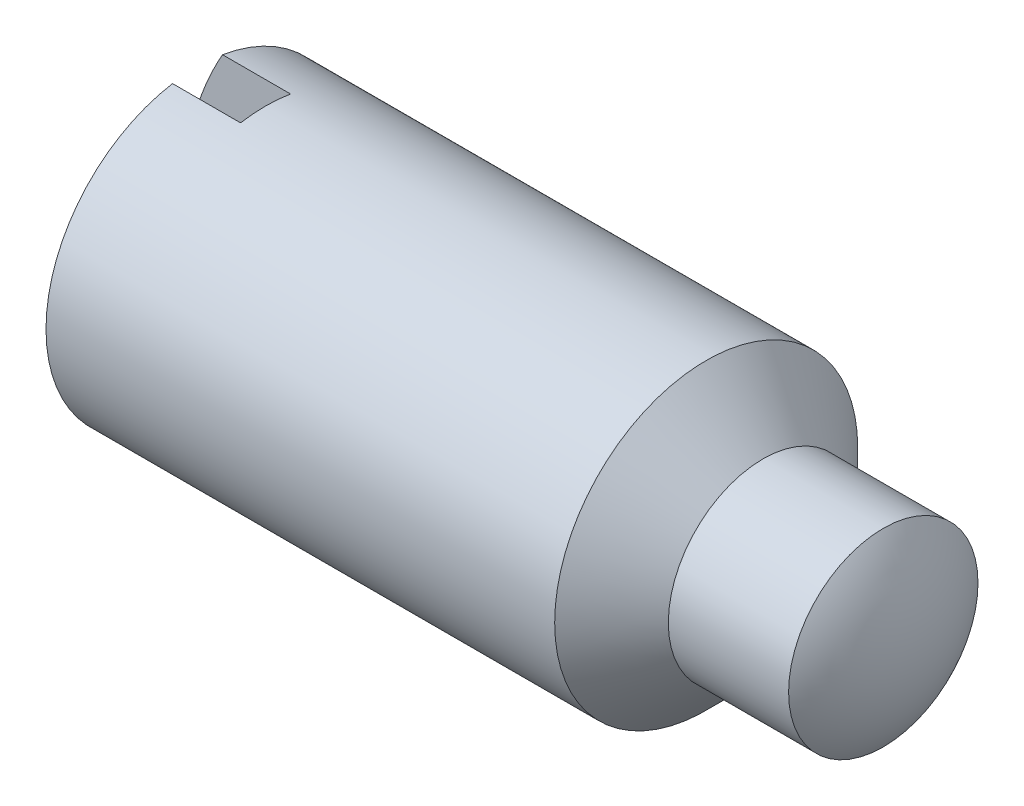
ISO-10303-21;
HEADER;
FILE_DESCRIPTION(('STEP AP214'),'2;1');
FILE_NAME('part.step','',(''),(''),'','','');
FILE_SCHEMA(('AUTOMOTIVE_DESIGN { 1 0 10303 214 1 1 1 1 }'));
ENDSEC;
DATA;
#1=APPLICATION_CONTEXT('core data for automotive mechanical design processes');
#2=APPLICATION_PROTOCOL_DEFINITION('international standard','automotive_design',2000,#1);
#3=PRODUCT_CONTEXT('',#1,'mechanical');
#4=PRODUCT('Part','Part','',(#3));
#5=PRODUCT_RELATED_PRODUCT_CATEGORY('part','',(#4));
#6=PRODUCT_DEFINITION_FORMATION('','',#4);
#7=PRODUCT_DEFINITION_CONTEXT('part definition',#1,'design');
#8=PRODUCT_DEFINITION('design','',#6,#7);
#9=PRODUCT_DEFINITION_SHAPE('','',#8);
#10=(LENGTH_UNIT() NAMED_UNIT(*) SI_UNIT(.MILLI.,.METRE.));
#11=(NAMED_UNIT(*) PLANE_ANGLE_UNIT() SI_UNIT($,.RADIAN.));
#12=(NAMED_UNIT(*) SI_UNIT($,.STERADIAN.) SOLID_ANGLE_UNIT());
#13=UNCERTAINTY_MEASURE_WITH_UNIT(LENGTH_MEASURE(1.E-05),#10,'distance_accuracy_value','');
#14=(GEOMETRIC_REPRESENTATION_CONTEXT(3) GLOBAL_UNCERTAINTY_ASSIGNED_CONTEXT((#13)) GLOBAL_UNIT_ASSIGNED_CONTEXT((#10,
#11,#12)) REPRESENTATION_CONTEXT('',''));
#15=CARTESIAN_POINT('',(0.,0.,0.));
#16=DIRECTION('',(0.,0.,1.));
#17=DIRECTION('',(1.,0.,0.));
#18=AXIS2_PLACEMENT_3D('',#15,#16,#17);
#19=CARTESIAN_POINT('',(4.,0.,0.));
#20=DIRECTION('',(-1.,0.,0.));
#21=DIRECTION('',(0.,0.,-1.));
#22=AXIS2_PLACEMENT_3D('',#19,#20,#21);
#23=SPHERICAL_SURFACE('',#22,4.);
#24=CARTESIAN_POINT('',(0.535898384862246,0.,0.));
#25=DIRECTION('',(-1.,0.,0.));
#26=DIRECTION('',(0.,0.,1.));
#27=AXIS2_PLACEMENT_3D('',#24,#25,#26);
#28=CIRCLE('',#27,2.);
#29=CARTESIAN_POINT('',(0.535898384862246,-1.97258713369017,0.33));
#30=VERTEX_POINT('',#29);
#31=CARTESIAN_POINT('',(0.535898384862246,1.97258713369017,0.33));
#32=VERTEX_POINT('',#31);
#33=EDGE_CURVE('E114',#30,#32,#28,.T.);
#34=ORIENTED_EDGE('',*,*,#33,.T.);
#35=CARTESIAN_POINT('',(4.,0.,0.33));
#36=DIRECTION('',(0.,0.,1.));
#37=DIRECTION('',(1.,0.,0.));
#38=AXIS2_PLACEMENT_3D('',#35,#36,#37);
#39=CIRCLE('',#38,3.9863642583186);
#40=EDGE_CURVE('E60',#32,#30,#39,.T.);
#41=ORIENTED_EDGE('',*,*,#40,.T.);
#42=EDGE_LOOP('',(#34,#41));
#43=FACE_BOUND('',#42,.T.);
#44=ADVANCED_FACE('F37',(#43),#23,.T.);
#45=CARTESIAN_POINT('',(4.,0.,-0.33));
#46=DIRECTION('',(0.,0.,-1.));
#47=DIRECTION('',(-1.,0.,0.));
#48=AXIS2_PLACEMENT_3D('',#45,#46,#47);
#49=CIRCLE('',#48,3.9863642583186);
#50=CARTESIAN_POINT('',(0.535898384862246,-1.97258713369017,-0.330000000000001));
#51=VERTEX_POINT('',#50);
#52=CARTESIAN_POINT('',(0.535898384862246,1.97258713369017,-0.33));
#53=VERTEX_POINT('',#52);
#54=EDGE_CURVE('E84',#51,#53,#49,.T.);
#55=ORIENTED_EDGE('',*,*,#54,.T.);
#56=EDGE_CURVE('E113',#53,#51,#28,.T.);
#57=ORIENTED_EDGE('',*,*,#56,.T.);
#58=EDGE_LOOP('',(#55,#57));
#59=FACE_BOUND('',#58,.T.);
#60=ADVANCED_FACE('F39',(#59),#23,.T.);
#61=CARTESIAN_POINT('',(7.9,0.,0.));
#62=DIRECTION('',(-1.,0.,0.));
#63=DIRECTION('',(0.,0.,-1.));
#64=AXIS2_PLACEMENT_3D('',#61,#62,#63);
#65=SPHERICAL_SURFACE('',#64,2.1);
#66=CARTESIAN_POINT('',(9.58745370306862,0.,0.));
#67=DIRECTION('',(-1.,0.,0.));
#68=DIRECTION('',(0.,0.,1.));
#69=AXIS2_PLACEMENT_3D('',#66,#67,#68);
#70=CIRCLE('',#69,1.25);
#71=CARTESIAN_POINT('',(9.58745370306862,0.,1.25));
#72=VERTEX_POINT('',#71);
#73=EDGE_CURVE('E102',#72,#72,#70,.T.);
#74=ORIENTED_EDGE('',*,*,#73,.F.);
#75=EDGE_LOOP('',(#74));
#76=FACE_BOUND('',#75,.T.);
#77=ADVANCED_FACE('F125',(#76),#65,.T.);
#78=CARTESIAN_POINT('',(-4.17939305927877,0.,0.));
#79=DIRECTION('',(-1.,0.,0.));
#80=DIRECTION('',(0.,0.,1.));
#81=AXIS2_PLACEMENT_3D('',#78,#79,#80);
#82=CYLINDRICAL_SURFACE('',#81,1.25);
#83=CARTESIAN_POINT('',(8.,0.,0.));
#84=DIRECTION('',(-1.,0.,0.));
#85=DIRECTION('',(0.,0.,1.));
#86=AXIS2_PLACEMENT_3D('',#83,#84,#85);
#87=CIRCLE('',#86,1.25);
#88=CARTESIAN_POINT('',(8.,0.,1.25));
#89=VERTEX_POINT('',#88);
#90=EDGE_CURVE('E104',#89,#89,#87,.T.);
#91=ORIENTED_EDGE('',*,*,#90,.F.);
#92=EDGE_LOOP('',(#91));
#93=FACE_BOUND('',#92,.T.);
#94=ORIENTED_EDGE('',*,*,#73,.T.);
#95=EDGE_LOOP('',(#94));
#96=FACE_BOUND('',#95,.T.);
#97=ADVANCED_FACE('F130',(#93,#96),#82,.T.);
#98=CARTESIAN_POINT('',(8.,0.,0.));
#99=DIRECTION('',(-1.,0.,0.));
#100=DIRECTION('',(0.,0.,1.));
#101=AXIS2_PLACEMENT_3D('',#98,#99,#100);
#102=CONICAL_SURFACE('',#101,1.25,0.78539816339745);
#103=CARTESIAN_POINT('',(7.25,0.,0.));
#104=DIRECTION('',(-1.,0.,0.));
#105=DIRECTION('',(0.,0.,1.));
#106=AXIS2_PLACEMENT_3D('',#103,#104,#105);
#107=CIRCLE('',#106,2.);
#108=CARTESIAN_POINT('',(7.25,0.,2.));
#109=VERTEX_POINT('',#108);
#110=EDGE_CURVE('E108',#109,#109,#107,.T.);
#111=ORIENTED_EDGE('',*,*,#110,.F.);
#112=EDGE_LOOP('',(#111));
#113=FACE_BOUND('',#112,.T.);
#114=ORIENTED_EDGE('',*,*,#90,.T.);
#115=EDGE_LOOP('',(#114));
#116=FACE_BOUND('',#115,.T.);
#117=ADVANCED_FACE('F135',(#113,#116),#102,.T.);
#118=CARTESIAN_POINT('',(-4.17939305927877,0.,0.));
#119=DIRECTION('',(-1.,0.,0.));
#120=DIRECTION('',(0.,0.,1.));
#121=AXIS2_PLACEMENT_3D('',#118,#119,#120);
#122=CYLINDRICAL_SURFACE('',#121,2.);
#123=DIRECTION('',(-1.,0.,0.));
#124=VECTOR('',#123,1.);
#125=CARTESIAN_POINT('',(-4.17939305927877,-1.97258713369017,0.33));
#126=LINE('',#125,#124);
#127=CARTESIAN_POINT('',(1.4336357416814,-1.97258713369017,0.33));
#128=VERTEX_POINT('',#127);
#129=EDGE_CURVE('E11',#30,#128,#126,.F.);
#130=ORIENTED_EDGE('',*,*,#129,.T.);
#131=CARTESIAN_POINT('',(1.4336357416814,0.,0.));
#132=DIRECTION('',(1.,0.,0.));
#133=DIRECTION('',(0.,0.,-1.));
#134=AXIS2_PLACEMENT_3D('',#131,#132,#133);
#135=CIRCLE('',#134,2.);
#136=CARTESIAN_POINT('',(1.4336357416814,-1.97258713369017,-0.33));
#137=VERTEX_POINT('',#136);
#138=EDGE_CURVE('E89',#128,#137,#135,.T.);
#139=ORIENTED_EDGE('',*,*,#138,.T.);
#140=DIRECTION('',(-1.,0.,0.));
#141=VECTOR('',#140,1.);
#142=CARTESIAN_POINT('',(-4.17939305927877,-1.97258713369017,-0.33));
#143=LINE('',#142,#141);
#144=EDGE_CURVE('E79',#137,#51,#143,.T.);
#145=ORIENTED_EDGE('',*,*,#144,.T.);
#146=ORIENTED_EDGE('',*,*,#56,.F.);
#147=DIRECTION('',(-1.,0.,0.));
#148=VECTOR('',#147,1.);
#149=CARTESIAN_POINT('',(-4.17939305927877,1.97258713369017,-0.33));
#150=LINE('',#149,#148);
#151=CARTESIAN_POINT('',(1.4336357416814,1.97258713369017,-0.33));
#152=VERTEX_POINT('',#151);
#153=EDGE_CURVE('E45',#53,#152,#150,.F.);
#154=ORIENTED_EDGE('',*,*,#153,.T.);
#155=CARTESIAN_POINT('',(1.4336357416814,1.97258713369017,0.33));
#156=VERTEX_POINT('',#155);
#157=EDGE_CURVE('E52',#152,#156,#135,.T.);
#158=ORIENTED_EDGE('',*,*,#157,.T.);
#159=DIRECTION('',(-1.,0.,0.));
#160=VECTOR('',#159,1.);
#161=CARTESIAN_POINT('',(-4.17939305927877,1.97258713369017,0.33));
#162=LINE('',#161,#160);
#163=EDGE_CURVE('E98',#156,#32,#162,.T.);
#164=ORIENTED_EDGE('',*,*,#163,.T.);
#165=ORIENTED_EDGE('',*,*,#33,.F.);
#166=EDGE_LOOP('',(#130,#139,#145,#146,#154,#158,#164,#165));
#167=FACE_BOUND('',#166,.T.);
#168=ORIENTED_EDGE('',*,*,#110,.T.);
#169=EDGE_LOOP('',(#168));
#170=FACE_BOUND('',#169,.T.);
#171=ADVANCED_FACE('F95',(#167,#170),#122,.T.);
#172=CARTESIAN_POINT('',(1.4336357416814,-2.,-0.33));
#173=DIRECTION('',(1.,0.,0.));
#174=DIRECTION('',(0.,0.,-1.));
#175=AXIS2_PLACEMENT_3D('',#172,#173,#174);
#176=PLANE('',#175);
#177=DIRECTION('',(0.,1.,0.));
#178=VECTOR('',#177,1.);
#179=CARTESIAN_POINT('',(1.4336357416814,-2.,-0.33));
#180=LINE('',#179,#178);
#181=EDGE_CURVE('E82',#137,#152,#180,.T.);
#182=ORIENTED_EDGE('',*,*,#181,.F.);
#183=ORIENTED_EDGE('',*,*,#138,.F.);
#184=DIRECTION('',(0.,1.,0.));
#185=VECTOR('',#184,1.);
#186=CARTESIAN_POINT('',(1.4336357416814,-2.,0.33));
#187=LINE('',#186,#185);
#188=EDGE_CURVE('E93',#128,#156,#187,.T.);
#189=ORIENTED_EDGE('',*,*,#188,.T.);
#190=ORIENTED_EDGE('',*,*,#157,.F.);
#191=EDGE_LOOP('',(#182,#183,#189,#190));
#192=FACE_BOUND('',#191,.T.);
#193=ADVANCED_FACE('F91',(#192),#176,.F.);
#194=CARTESIAN_POINT('',(1.4336357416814,-2.,0.33));
#195=DIRECTION('',(0.,0.,1.));
#196=DIRECTION('',(1.,0.,0.));
#197=AXIS2_PLACEMENT_3D('',#194,#195,#196);
#198=PLANE('',#197);
#199=ORIENTED_EDGE('',*,*,#188,.F.);
#200=ORIENTED_EDGE('',*,*,#129,.F.);
#201=ORIENTED_EDGE('',*,*,#40,.F.);
#202=ORIENTED_EDGE('',*,*,#163,.F.);
#203=EDGE_LOOP('',(#199,#200,#201,#202));
#204=FACE_BOUND('',#203,.T.);
#205=ADVANCED_FACE('F119',(#204),#198,.F.);
#206=CARTESIAN_POINT('',(1.4336357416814,-2.,-0.33));
#207=DIRECTION('',(0.,0.,-1.));
#208=DIRECTION('',(-1.,0.,0.));
#209=AXIS2_PLACEMENT_3D('',#206,#207,#208);
#210=PLANE('',#209);
#211=ORIENTED_EDGE('',*,*,#181,.T.);
#212=ORIENTED_EDGE('',*,*,#153,.F.);
#213=ORIENTED_EDGE('',*,*,#54,.F.);
#214=ORIENTED_EDGE('',*,*,#144,.F.);
#215=EDGE_LOOP('',(#211,#212,#213,#214));
#216=FACE_BOUND('',#215,.T.);
#217=ADVANCED_FACE('F80',(#216),#210,.F.);
#218=CLOSED_SHELL('',(#44,#60,#77,#97,#117,#171,#193,#205,#217));
#219=MANIFOLD_SOLID_BREP('B2',#218);
#220=ADVANCED_BREP_SHAPE_REPRESENTATION('',(#18,#219),#14);
#221=SHAPE_DEFINITION_REPRESENTATION(#9,#220);
ENDSEC;
END-ISO-10303-21;
